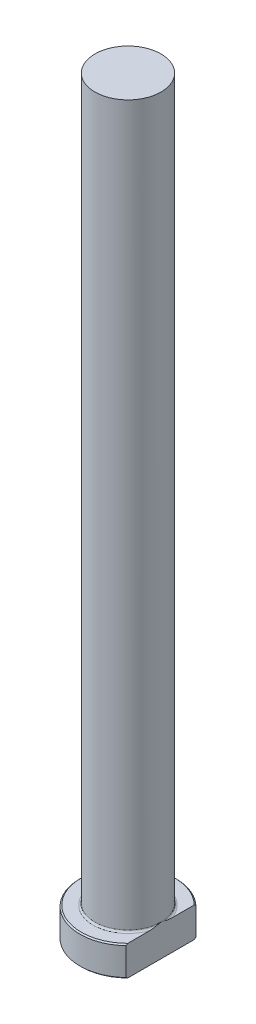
ISO-10303-21;
HEADER;
FILE_DESCRIPTION(('STEP AP214'),'2;1');
FILE_NAME('part.step','',(''),(''),'','','');
FILE_SCHEMA(('AUTOMOTIVE_DESIGN { 1 0 10303 214 1 1 1 1 }'));
ENDSEC;
DATA;
#1=APPLICATION_CONTEXT('core data for automotive mechanical design processes');
#2=APPLICATION_PROTOCOL_DEFINITION('international standard','automotive_design',2000,#1);
#3=PRODUCT_CONTEXT('',#1,'mechanical');
#4=PRODUCT('Part','Part','',(#3));
#5=PRODUCT_RELATED_PRODUCT_CATEGORY('part','',(#4));
#6=PRODUCT_DEFINITION_FORMATION('','',#4);
#7=PRODUCT_DEFINITION_CONTEXT('part definition',#1,'design');
#8=PRODUCT_DEFINITION('design','',#6,#7);
#9=PRODUCT_DEFINITION_SHAPE('','',#8);
#10=(LENGTH_UNIT() NAMED_UNIT(*) SI_UNIT(.MILLI.,.METRE.));
#11=(NAMED_UNIT(*) PLANE_ANGLE_UNIT() SI_UNIT($,.RADIAN.));
#12=(NAMED_UNIT(*) SI_UNIT($,.STERADIAN.) SOLID_ANGLE_UNIT());
#13=UNCERTAINTY_MEASURE_WITH_UNIT(LENGTH_MEASURE(1.E-05),#10,'distance_accuracy_value','');
#14=(GEOMETRIC_REPRESENTATION_CONTEXT(3) GLOBAL_UNCERTAINTY_ASSIGNED_CONTEXT((#13)) GLOBAL_UNIT_ASSIGNED_CONTEXT((#10,
#11,#12)) REPRESENTATION_CONTEXT('',''));
#15=CARTESIAN_POINT('',(0.,0.,0.));
#16=DIRECTION('',(0.,0.,1.));
#17=DIRECTION('',(1.,0.,0.));
#18=AXIS2_PLACEMENT_3D('',#15,#16,#17);
#19=CARTESIAN_POINT('',(0.,0.,0.));
#20=DIRECTION('',(0.,-1.,0.));
#21=DIRECTION('',(0.,0.,-1.));
#22=AXIS2_PLACEMENT_3D('',#19,#20,#21);
#23=PLANE('',#22);
#24=CARTESIAN_POINT('',(0.,0.,0.));
#25=DIRECTION('',(0.,-1.,0.));
#26=DIRECTION('',(0.,0.,-1.));
#27=AXIS2_PLACEMENT_3D('',#24,#25,#26);
#28=CIRCLE('',#27,7.80000000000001);
#29=CARTESIAN_POINT('',(5.49999999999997,0.,5.53082272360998));
#30=VERTEX_POINT('',#29);
#31=CARTESIAN_POINT('',(5.49999999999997,0.,-5.53082272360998));
#32=VERTEX_POINT('',#31);
#33=EDGE_CURVE('E98',#30,#32,#28,.T.);
#34=ORIENTED_EDGE('',*,*,#33,.T.);
#35=DIRECTION('',(0.,0.,1.));
#36=VECTOR('',#35,1.);
#37=CARTESIAN_POINT('',(5.49999999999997,0.,-5.80947501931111));
#38=LINE('',#37,#36);
#39=EDGE_CURVE('E83',#32,#30,#38,.T.);
#40=ORIENTED_EDGE('',*,*,#39,.T.);
#41=EDGE_LOOP('',(#34,#40));
#42=FACE_BOUND('',#41,.T.);
#43=ADVANCED_FACE('F32',(#42),#23,.T.);
#44=CARTESIAN_POINT('',(0.,259.958771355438,0.));
#45=DIRECTION('',(0.,1.,0.));
#46=DIRECTION('',(0.,0.,1.));
#47=AXIS2_PLACEMENT_3D('',#44,#45,#46);
#48=CYLINDRICAL_SURFACE('',#47,7.99999999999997);
#49=CARTESIAN_POINT('',(0.,4.79999999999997,0.));
#50=DIRECTION('',(0.,1.,0.));
#51=DIRECTION('',(0.,0.,1.));
#52=AXIS2_PLACEMENT_3D('',#49,#50,#51);
#53=CIRCLE('',#52,7.99999999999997);
#54=CARTESIAN_POINT('',(5.49999999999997,4.79999999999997,5.80947501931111));
#55=VERTEX_POINT('',#54);
#56=CARTESIAN_POINT('',(5.49999999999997,4.79999999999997,-5.80947501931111));
#57=VERTEX_POINT('',#56);
#58=EDGE_CURVE('E104',#55,#57,#53,.F.);
#59=ORIENTED_EDGE('',*,*,#58,.T.);
#60=DIRECTION('',(0.,-1.,0.));
#61=VECTOR('',#60,1.);
#62=CARTESIAN_POINT('',(5.49999999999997,125.,-5.80947501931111));
#63=LINE('',#62,#61);
#64=CARTESIAN_POINT('',(5.49999999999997,0.199999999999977,-5.80947501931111));
#65=VERTEX_POINT('',#64);
#66=EDGE_CURVE('E183',#57,#65,#63,.T.);
#67=ORIENTED_EDGE('',*,*,#66,.T.);
#68=CARTESIAN_POINT('',(0.,0.199999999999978,0.));
#69=DIRECTION('',(0.,-1.,0.));
#70=DIRECTION('',(0.,0.,-1.));
#71=AXIS2_PLACEMENT_3D('',#68,#69,#70);
#72=CIRCLE('',#71,7.99999999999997);
#73=CARTESIAN_POINT('',(5.49999999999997,0.199999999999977,5.80947501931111));
#74=VERTEX_POINT('',#73);
#75=EDGE_CURVE('E100',#65,#74,#72,.F.);
#76=ORIENTED_EDGE('',*,*,#75,.T.);
#77=DIRECTION('',(0.,-1.,0.));
#78=VECTOR('',#77,1.);
#79=CARTESIAN_POINT('',(5.49999999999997,125.,5.80947501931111));
#80=LINE('',#79,#78);
#81=EDGE_CURVE('E93',#55,#74,#80,.T.);
#82=ORIENTED_EDGE('',*,*,#81,.F.);
#83=EDGE_LOOP('',(#59,#67,#76,#82));
#84=FACE_BOUND('',#83,.T.);
#85=ADVANCED_FACE('F158',(#84),#48,.T.);
#86=CARTESIAN_POINT('',(-7.99999999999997,5.,0.));
#87=DIRECTION('',(0.,1.,0.));
#88=DIRECTION('',(0.,0.,1.));
#89=AXIS2_PLACEMENT_3D('',#86,#87,#88);
#90=PLANE('',#89);
#91=CARTESIAN_POINT('',(0.,5.,0.));
#92=DIRECTION('',(0.,1.,0.));
#93=DIRECTION('',(0.,0.,1.));
#94=AXIS2_PLACEMENT_3D('',#91,#92,#93);
#95=CIRCLE('',#94,7.79999999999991);
#96=CARTESIAN_POINT('',(5.49999999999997,5.,-5.53082272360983));
#97=VERTEX_POINT('',#96);
#98=CARTESIAN_POINT('',(5.49999999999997,5.,5.53082272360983));
#99=VERTEX_POINT('',#98);
#100=EDGE_CURVE('E178',#97,#99,#95,.T.);
#101=ORIENTED_EDGE('',*,*,#100,.T.);
#102=DIRECTION('',(0.,0.,-1.));
#103=VECTOR('',#102,1.);
#104=CARTESIAN_POINT('',(5.49999999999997,5.,0.));
#105=LINE('',#104,#103);
#106=CARTESIAN_POINT('',(5.49999999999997,4.99999999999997,1.84119526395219));
#107=VERTEX_POINT('',#106);
#108=EDGE_CURVE('E57',#99,#107,#105,.T.);
#109=ORIENTED_EDGE('',*,*,#108,.T.);
#110=CARTESIAN_POINT('',(0.,5.,0.));
#111=DIRECTION('',(0.,1.,0.));
#112=DIRECTION('',(0.,0.,1.));
#113=AXIS2_PLACEMENT_3D('',#110,#111,#112);
#114=CIRCLE('',#113,5.79999999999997);
#115=CARTESIAN_POINT('',(5.49999999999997,4.99999999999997,-1.84119526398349));
#116=VERTEX_POINT('',#115);
#117=EDGE_CURVE('E107',#107,#116,#114,.F.);
#118=ORIENTED_EDGE('',*,*,#117,.T.);
#119=EDGE_CURVE('E136',#116,#97,#105,.T.);
#120=ORIENTED_EDGE('',*,*,#119,.T.);
#121=EDGE_LOOP('',(#101,#109,#118,#120));
#122=FACE_BOUND('',#121,.T.);
#123=ADVANCED_FACE('F147',(#122),#90,.T.);
#124=CARTESIAN_POINT('',(0.,5.,0.));
#125=DIRECTION('',(0.,-1.,0.));
#126=DIRECTION('',(0.,0.,-1.));
#127=AXIS2_PLACEMENT_3D('',#124,#125,#126);
#128=CONICAL_SURFACE('',#127,7.7999999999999,0.785398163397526);
#129=ORIENTED_EDGE('',*,*,#58,.F.);
#130=CARTESIAN_POINT('',(5.49999999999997,-1.11515403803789,12.7820777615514));
#131=CARTESIAN_POINT('',(5.49999999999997,-0.941517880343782,12.5930460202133));
#132=CARTESIAN_POINT('',(5.49999999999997,-0.768204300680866,12.4037180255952));
#133=CARTESIAN_POINT('',(5.49999999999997,-0.422318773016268,12.0243831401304));
#134=CARTESIAN_POINT('',(5.49999999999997,-0.249746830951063,11.8343762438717));
#135=CARTESIAN_POINT('',(5.49999999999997,0.266785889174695,11.2631256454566));
#136=CARTESIAN_POINT('',(5.49999999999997,0.609484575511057,10.8807378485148));
#137=CARTESIAN_POINT('',(5.49999999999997,1.2925654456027,10.1095655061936));
#138=CARTESIAN_POINT('',(5.49999999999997,1.63291928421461,9.72075580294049));
#139=CARTESIAN_POINT('',(5.49999999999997,2.30738282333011,8.93782165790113));
#140=CARTESIAN_POINT('',(5.49999999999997,2.64149328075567,8.54369787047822));
#141=CARTESIAN_POINT('',(5.49999999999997,3.24251408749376,7.81851180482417));
#142=CARTESIAN_POINT('',(5.49999999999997,3.51085021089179,7.48863708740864));
#143=CARTESIAN_POINT('',(5.49999999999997,3.90712731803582,6.98880713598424));
#144=CARTESIAN_POINT('',(5.49999999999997,4.03820076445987,6.82133570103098));
#145=CARTESIAN_POINT('',(5.49999999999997,4.2978404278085,6.48446279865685));
#146=CARTESIAN_POINT('',(5.49999999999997,4.42640670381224,6.31506137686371));
#147=CARTESIAN_POINT('',(5.49999999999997,4.68038690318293,5.97419641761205));
#148=CARTESIAN_POINT('',(5.49999999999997,4.80580413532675,5.80273535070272));
#149=CARTESIAN_POINT('',(5.49999999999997,5.05297330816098,5.45719748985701));
#150=CARTESIAN_POINT('',(5.49999999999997,5.17472543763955,5.28312083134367));
#151=CARTESIAN_POINT('',(5.49999999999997,5.41367984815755,4.93196486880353));
#152=CARTESIAN_POINT('',(5.49999999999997,5.53088395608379,4.75488681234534));
#153=CARTESIAN_POINT('',(5.49999999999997,5.75968250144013,4.3971560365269));
#154=CARTESIAN_POINT('',(5.49999999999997,5.87127761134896,4.21650374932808));
#155=CARTESIAN_POINT('',(5.49999999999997,6.08629942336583,3.8529266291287));
#156=CARTESIAN_POINT('',(5.49999999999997,6.18979942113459,3.67004539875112));
#157=CARTESIAN_POINT('',(5.49999999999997,6.38808999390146,3.29955746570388));
#158=CARTESIAN_POINT('',(5.49999999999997,6.48287965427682,3.11195026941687));
#159=CARTESIAN_POINT('',(5.49999999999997,6.66127167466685,2.73169295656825));
#160=CARTESIAN_POINT('',(5.49999999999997,6.74488626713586,2.53904863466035));
#161=CARTESIAN_POINT('',(5.49999999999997,6.89808375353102,2.14822839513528));
#162=CARTESIAN_POINT('',(5.49999999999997,6.96767069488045,1.95005409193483));
#163=CARTESIAN_POINT('',(5.49999999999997,7.07670147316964,1.59030424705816));
#164=CARTESIAN_POINT('',(5.49999999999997,7.1194052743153,1.42972239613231));
#165=CARTESIAN_POINT('',(5.49999999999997,7.19217730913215,1.10570020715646));
#166=CARTESIAN_POINT('',(5.49999999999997,7.2222472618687,0.942260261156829));
#167=CARTESIAN_POINT('',(5.49999999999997,7.26823317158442,0.613832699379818));
#168=CARTESIAN_POINT('',(5.49999999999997,7.28418798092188,0.448850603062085));
#169=CARTESIAN_POINT('',(5.49999999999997,7.30121051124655,0.118111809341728));
#170=CARTESIAN_POINT('',(5.49999999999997,7.3022786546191,-0.0476448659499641));
#171=CARTESIAN_POINT('',(5.49999999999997,7.28946437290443,-0.37864328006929));
#172=CARTESIAN_POINT('',(5.49999999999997,7.27557532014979,-0.543884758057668));
#173=CARTESIAN_POINT('',(5.49999999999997,7.23360586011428,-0.872541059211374));
#174=CARTESIAN_POINT('',(5.49999999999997,7.20552424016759,-1.03595572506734));
#175=CARTESIAN_POINT('',(5.49999999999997,7.13645491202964,-1.36050703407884));
#176=CARTESIAN_POINT('',(5.49999999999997,7.09542895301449,-1.52163542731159));
#177=CARTESIAN_POINT('',(5.49999999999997,7.0022009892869,-1.8405836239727));
#178=CARTESIAN_POINT('',(5.49999999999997,6.94999898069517,-1.99840342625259));
#179=CARTESIAN_POINT('',(5.49999999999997,6.82412729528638,-2.34351289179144));
#180=CARTESIAN_POINT('',(5.49999999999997,6.74825204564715,-2.52999311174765));
#181=CARTESIAN_POINT('',(5.49999999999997,6.58537605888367,-2.89807095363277));
#182=CARTESIAN_POINT('',(5.49999999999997,6.49837001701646,-3.0796661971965));
#183=CARTESIAN_POINT('',(5.49999999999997,6.31536700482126,-3.43865575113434));
#184=CARTESIAN_POINT('',(5.49999999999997,6.21935375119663,-3.61604169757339));
#185=CARTESIAN_POINT('',(5.49999999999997,6.02029718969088,-3.96676299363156));
#186=CARTESIAN_POINT('',(5.49999999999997,5.91725492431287,-4.14009893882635));
#187=CARTESIAN_POINT('',(5.49999999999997,5.70428964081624,-4.48528329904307));
#188=CARTESIAN_POINT('',(5.49999999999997,5.59430018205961,-4.65709053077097));
#189=CARTESIAN_POINT('',(5.49999999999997,5.36966321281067,-4.99762683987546));
#190=CARTESIAN_POINT('',(5.49999999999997,5.25501557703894,-5.16635583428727));
#191=CARTESIAN_POINT('',(5.49999999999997,5.02205528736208,-5.50098485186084));
#192=CARTESIAN_POINT('',(5.49999999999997,4.90374674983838,-5.66688774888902));
#193=CARTESIAN_POINT('',(5.49999999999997,4.66400808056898,-5.99642589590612));
#194=CARTESIAN_POINT('',(5.49999999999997,4.54257783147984,-6.16006106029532));
#195=CARTESIAN_POINT('',(5.49999999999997,4.20154795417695,-6.6120771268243));
#196=CARTESIAN_POINT('',(5.49999999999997,3.97915323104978,-6.89834873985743));
#197=CARTESIAN_POINT('',(5.49999999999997,3.5283586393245,-7.4661257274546));
#198=CARTESIAN_POINT('',(5.49999999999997,3.29995838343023,-7.74763079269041));
#199=CARTESIAN_POINT('',(5.49999999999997,2.83846100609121,-8.30706072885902));
#200=CARTESIAN_POINT('',(5.49999999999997,2.60536095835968,-8.58498318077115));
#201=CARTESIAN_POINT('',(5.49999999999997,2.1356330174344,-9.13783071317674));
#202=CARTESIAN_POINT('',(5.49999999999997,1.89900507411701,-9.41275575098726));
#203=CARTESIAN_POINT('',(5.49999999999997,1.43345389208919,-9.94811769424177));
#204=CARTESIAN_POINT('',(5.49999999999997,1.20465068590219,-10.2086591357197));
#205=CARTESIAN_POINT('',(5.49999999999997,0.744976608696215,-10.7279148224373));
#206=CARTESIAN_POINT('',(5.49999999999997,0.514105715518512,-10.986629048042));
#207=CARTESIAN_POINT('',(5.49999999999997,0.0509694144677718,-11.5022006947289));
#208=CARTESIAN_POINT('',(5.49999999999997,-0.181293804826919,-11.7590600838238));
#209=CARTESIAN_POINT('',(5.49999999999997,-0.647231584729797,-12.2714820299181));
#210=CARTESIAN_POINT('',(5.49999999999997,-0.880906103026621,-12.5270446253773));
#211=CARTESIAN_POINT('',(5.49999999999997,-1.11515403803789,-12.7820777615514));
#212=B_SPLINE_CURVE_WITH_KNOTS('',3,(#130,#131,#132,#133,#134,#135,#136,#137,#138,#139,#140,
#141,#142,#143,#144,#145,#146,#147,#148,#149,#150,#151,#152,#153,#154,#155,#156,#157,#158,#159,
#160,#161,#162,#163,#164,#165,#166,#167,#168,#169,#170,#171,#172,#173,#174,#175,#176,#177,#178,
#179,#180,#181,#182,#183,#184,#185,#186,#187,#188,#189,#190,#191,#192,#193,#194,#195,#196,#197,
#198,#199,#200,#201,#202,#203,#204,#205,#206,#207,#208,#209,#210,#211),.UNSPECIFIED.,.F.,.F.,(4,
2,2,2,2,2,2,2,2,2,2,2,2,2,2,2,2,2,2,2,2,2,2,2,2,2,2,2,2,2,2,2,2,2,2,2,2,2,2,2,4),(0.,
0.770026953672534,1.54006005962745,3.08047615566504,4.63063153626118,6.18059774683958,
7.45618053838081,8.09416066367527,8.73212573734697,9.36938977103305,10.0066209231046,
10.6435933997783,11.2804893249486,11.910716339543,12.5410094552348,13.1706068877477,
13.8000224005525,14.2980757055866,14.7960612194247,15.2926717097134,15.789268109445,
16.2860846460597,16.7829436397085,17.281284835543,17.7796262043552,18.3831348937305,
18.9869322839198,19.5918430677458,20.1966643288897,20.8085675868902,21.4204873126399,
22.0317423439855,22.6430203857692,23.7304168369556,24.8178835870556,25.9060497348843,
26.9942313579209,28.0344561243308,29.0746920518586,30.1135832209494,31.1524433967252),.UNSPECIFIED.);
#213=EDGE_CURVE('E135',#55,#99,#212,.T.);
#214=ORIENTED_EDGE('',*,*,#213,.T.);
#215=ORIENTED_EDGE('',*,*,#100,.F.);
#216=EDGE_CURVE('E127',#97,#57,#212,.T.);
#217=ORIENTED_EDGE('',*,*,#216,.T.);
#218=EDGE_LOOP('',(#129,#214,#215,#217));
#219=FACE_BOUND('',#218,.T.);
#220=ADVANCED_FACE('F143',(#219),#128,.T.);
#221=CARTESIAN_POINT('',(0.,0.199999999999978,0.));
#222=DIRECTION('',(0.,1.,0.));
#223=DIRECTION('',(0.,0.,1.));
#224=AXIS2_PLACEMENT_3D('',#221,#222,#223);
#225=CONICAL_SURFACE('',#224,7.99999999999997,0.785398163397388);
#226=ORIENTED_EDGE('',*,*,#75,.F.);
#227=CARTESIAN_POINT('',(5.49999999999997,6.11515403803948,-12.7820777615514));
#228=CARTESIAN_POINT('',(5.49999999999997,5.94151788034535,-12.5930460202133));
#229=CARTESIAN_POINT('',(5.49999999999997,5.76820430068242,-12.4037180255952));
#230=CARTESIAN_POINT('',(5.49999999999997,5.42231877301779,-12.0243831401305));
#231=CARTESIAN_POINT('',(5.49999999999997,5.24974683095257,-11.8343762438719));
#232=CARTESIAN_POINT('',(5.49999999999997,4.73321411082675,-11.2631256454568));
#233=CARTESIAN_POINT('',(5.49999999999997,4.39051542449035,-10.8807378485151));
#234=CARTESIAN_POINT('',(5.49999999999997,3.70743455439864,-10.1095655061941));
#235=CARTESIAN_POINT('',(5.49999999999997,3.3670807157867,-9.72075580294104));
#236=CARTESIAN_POINT('',(5.49999999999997,2.69261717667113,-8.93782165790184));
#237=CARTESIAN_POINT('',(5.49999999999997,2.35850671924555,-8.543697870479));
#238=CARTESIAN_POINT('',(5.49999999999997,1.75748591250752,-7.81851180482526));
#239=CARTESIAN_POINT('',(5.49999999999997,1.48914978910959,-7.48863708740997));
#240=CARTESIAN_POINT('',(5.49999999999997,1.0928726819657,-6.98880713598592));
#241=CARTESIAN_POINT('',(5.49999999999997,0.961799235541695,-6.82133570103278));
#242=CARTESIAN_POINT('',(5.49999999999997,0.702159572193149,-6.48446279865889));
#243=CARTESIAN_POINT('',(5.49999999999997,0.573593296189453,-6.31506137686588));
#244=CARTESIAN_POINT('',(5.49999999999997,0.319613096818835,-5.97419641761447));
#245=CARTESIAN_POINT('',(5.49999999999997,0.194195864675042,-5.80273535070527));
#246=CARTESIAN_POINT('',(5.49999999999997,-0.0529733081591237,-5.45719748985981));
#247=CARTESIAN_POINT('',(5.49999999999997,-0.17472543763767,-5.2831208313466));
#248=CARTESIAN_POINT('',(5.49999999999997,-0.413679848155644,-4.93196486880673));
#249=CARTESIAN_POINT('',(5.49999999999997,-0.530883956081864,-4.75488681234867));
#250=CARTESIAN_POINT('',(5.49999999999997,-0.759682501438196,-4.39715603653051));
#251=CARTESIAN_POINT('',(5.49999999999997,-0.871277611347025,-4.21650374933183));
#252=CARTESIAN_POINT('',(5.49999999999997,-1.08629942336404,-3.85292662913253));
#253=CARTESIAN_POINT('',(5.49999999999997,-1.18979942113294,-3.67004539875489));
#254=CARTESIAN_POINT('',(5.49999999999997,-1.38808999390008,-3.29955746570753));
#255=CARTESIAN_POINT('',(5.49999999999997,-1.48287965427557,-3.11195026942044));
#256=CARTESIAN_POINT('',(5.49999999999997,-1.66127167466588,-2.73169295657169));
#257=CARTESIAN_POINT('',(5.49999999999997,-1.74488626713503,-2.53904863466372));
#258=CARTESIAN_POINT('',(5.49999999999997,-1.89808375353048,-2.14822839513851));
#259=CARTESIAN_POINT('',(5.49999999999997,-1.96767069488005,-1.95005409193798));
#260=CARTESIAN_POINT('',(5.49999999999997,-2.07670147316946,-1.59030424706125));
#261=CARTESIAN_POINT('',(5.49999999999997,-2.11940527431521,-1.42972239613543));
#262=CARTESIAN_POINT('',(5.49999999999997,-2.19217730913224,-1.10570020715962));
#263=CARTESIAN_POINT('',(5.49999999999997,-2.22224726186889,-0.942260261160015));
#264=CARTESIAN_POINT('',(5.49999999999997,-2.2682331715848,-0.613832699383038));
#265=CARTESIAN_POINT('',(5.49999999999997,-2.28418798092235,-0.448850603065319));
#266=CARTESIAN_POINT('',(5.49999999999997,-2.30121051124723,-0.118111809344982));
#267=CARTESIAN_POINT('',(5.49999999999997,-2.30227865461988,0.0476448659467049));
#268=CARTESIAN_POINT('',(5.49999999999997,-2.2894643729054,0.378643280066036));
#269=CARTESIAN_POINT('',(5.49999999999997,-2.27557532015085,0.543884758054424));
#270=CARTESIAN_POINT('',(5.49999999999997,-2.23360586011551,0.872541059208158));
#271=CARTESIAN_POINT('',(5.49999999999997,-2.2055242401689,1.03595572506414));
#272=CARTESIAN_POINT('',(5.49999999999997,-2.1364549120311,1.36050703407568));
#273=CARTESIAN_POINT('',(5.49999999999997,-2.09542895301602,1.52163542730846));
#274=CARTESIAN_POINT('',(5.49999999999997,-2.00220098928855,1.8405836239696));
#275=CARTESIAN_POINT('',(5.49999999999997,-1.94999898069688,1.99840342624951));
#276=CARTESIAN_POINT('',(5.49999999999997,-1.82412729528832,2.34351289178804));
#277=CARTESIAN_POINT('',(5.49999999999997,-1.7482520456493,2.52999311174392));
#278=CARTESIAN_POINT('',(5.49999999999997,-1.58537605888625,2.8980709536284));
#279=CARTESIAN_POINT('',(5.49999999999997,-1.49837001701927,3.07966619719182));
#280=CARTESIAN_POINT('',(5.49999999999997,-1.31536700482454,3.43865575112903));
#281=CARTESIAN_POINT('',(5.49999999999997,-1.21935375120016,3.61604169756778));
#282=CARTESIAN_POINT('',(5.49999999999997,-1.02029718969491,3.96676299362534));
#283=CARTESIAN_POINT('',(5.49999999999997,-0.917254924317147,4.14009893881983));
#284=CARTESIAN_POINT('',(5.49999999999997,-0.704289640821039,4.48528329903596));
#285=CARTESIAN_POINT('',(5.49999999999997,-0.594300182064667,4.65709053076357));
#286=CARTESIAN_POINT('',(5.49999999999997,-0.369663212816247,4.99762683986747));
#287=CARTESIAN_POINT('',(5.49999999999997,-0.255015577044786,5.16635583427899));
#288=CARTESIAN_POINT('',(5.49999999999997,-0.0220552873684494,5.50098485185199));
#289=CARTESIAN_POINT('',(5.49999999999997,0.096253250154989,5.66688774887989));
#290=CARTESIAN_POINT('',(5.49999999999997,0.335991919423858,5.99642589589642));
#291=CARTESIAN_POINT('',(5.49999999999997,0.457422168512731,6.16006106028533));
#292=CARTESIAN_POINT('',(5.49999999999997,0.798452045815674,6.61207712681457));
#293=CARTESIAN_POINT('',(5.49999999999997,1.02084676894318,6.89834873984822));
#294=CARTESIAN_POINT('',(5.49999999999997,1.47164136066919,7.46612572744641));
#295=CARTESIAN_POINT('',(5.49999999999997,1.70004161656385,7.74763079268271));
#296=CARTESIAN_POINT('',(5.49999999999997,2.16153899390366,8.30706072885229));
#297=CARTESIAN_POINT('',(5.49999999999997,2.3946390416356,8.58498318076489));
#298=CARTESIAN_POINT('',(5.49999999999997,2.86436698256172,9.13783071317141));
#299=CARTESIAN_POINT('',(5.49999999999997,3.10099492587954,9.41275575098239));
#300=CARTESIAN_POINT('',(5.49999999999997,3.56654610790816,9.94811769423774));
#301=CARTESIAN_POINT('',(5.49999999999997,3.79534931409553,10.2086591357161));
#302=CARTESIAN_POINT('',(5.49999999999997,4.25502339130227,10.7279148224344));
#303=CARTESIAN_POINT('',(5.49999999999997,4.48589428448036,10.9866290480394));
#304=CARTESIAN_POINT('',(5.49999999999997,4.94903058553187,11.5022006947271));
#305=CARTESIAN_POINT('',(5.49999999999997,5.18129380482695,11.7590600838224));
#306=CARTESIAN_POINT('',(5.49999999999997,5.6472315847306,12.2714820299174));
#307=CARTESIAN_POINT('',(5.49999999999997,5.88090610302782,12.5270446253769));
#308=CARTESIAN_POINT('',(5.49999999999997,6.11515403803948,12.7820777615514));
#309=B_SPLINE_CURVE_WITH_KNOTS('',3,(#227,#228,#229,#230,#231,#232,#233,#234,#235,#236,#237,
#238,#239,#240,#241,#242,#243,#244,#245,#246,#247,#248,#249,#250,#251,#252,#253,#254,#255,#256,
#257,#258,#259,#260,#261,#262,#263,#264,#265,#266,#267,#268,#269,#270,#271,#272,#273,#274,#275,
#276,#277,#278,#279,#280,#281,#282,#283,#284,#285,#286,#287,#288,#289,#290,#291,#292,#293,#294,
#295,#296,#297,#298,#299,#300,#301,#302,#303,#304,#305,#306,#307,#308),.UNSPECIFIED.,.F.,.F.,(4,
2,2,2,2,2,2,2,2,2,2,2,2,2,2,2,2,2,2,2,2,2,2,2,2,2,2,2,2,2,2,2,2,2,2,2,2,2,2,2,4),(0.,
0.770026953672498,1.54006005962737,3.08047615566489,4.63063153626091,6.1805977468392,
7.4561805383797,8.0941606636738,8.73212573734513,9.36938977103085,10.006620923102,
10.6435933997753,11.2804893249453,11.9107163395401,12.5410094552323,13.1706068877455,
13.8000224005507,14.2980757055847,14.7960612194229,15.2926717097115,15.7892681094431,
16.2860846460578,16.7829436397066,17.2812848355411,17.7796262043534,18.3831348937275,
18.9869322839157,19.5918430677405,20.1966643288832,20.8085675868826,21.4204873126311,
22.0317423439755,22.643020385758,23.7304168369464,24.8178835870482,25.9060497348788,
26.9942313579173,28.0344561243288,29.0746920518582,30.1135832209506,31.1524433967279),.UNSPECIFIED.);
#310=EDGE_CURVE('E86',#65,#32,#309,.T.);
#311=ORIENTED_EDGE('',*,*,#310,.T.);
#312=ORIENTED_EDGE('',*,*,#33,.F.);
#313=EDGE_CURVE('E89',#30,#74,#309,.T.);
#314=ORIENTED_EDGE('',*,*,#313,.T.);
#315=EDGE_LOOP('',(#226,#311,#312,#314));
#316=FACE_BOUND('',#315,.T.);
#317=ADVANCED_FACE('F97',(#316),#225,.T.);
#318=CARTESIAN_POINT('',(0.,5.29999999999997,0.));
#319=DIRECTION('',(0.,1.,0.));
#320=DIRECTION('',(0.,0.,1.));
#321=AXIS2_PLACEMENT_3D('',#318,#319,#320);
#322=TOROIDAL_SURFACE('',#321,5.79999999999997,0.3);
#323=CARTESIAN_POINT('',(5.49999999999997,5.29999999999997,0.));
#324=CARTESIAN_POINT('',(5.49999999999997,5.30000062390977,1.37321730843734E-10));
#325=CARTESIAN_POINT('',(5.49999999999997,5.30000124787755,-2.69376376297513E-07));
#326=CARTESIAN_POINT('',(5.49999999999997,5.30000240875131,-9.99151691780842E-07));
#327=CARTESIAN_POINT('',(5.49999999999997,5.30000292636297,-1.47834826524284E-06));
#328=CARTESIAN_POINT('',(5.49999999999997,5.30000401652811,-2.63038637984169E-06));
#329=CARTESIAN_POINT('',(5.49999999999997,5.3000045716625,-3.32194614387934E-06));
#330=CARTESIAN_POINT('',(5.49999999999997,5.30000555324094,-4.74435536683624E-06));
#331=CARTESIAN_POINT('',(5.49999999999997,5.30000598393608,-5.47253605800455E-06));
#332=CARTESIAN_POINT('',(5.49999999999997,5.30000761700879,-8.33560288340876E-06));
#333=CARTESIAN_POINT('',(5.49999999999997,5.30000873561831,-1.05221151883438E-05));
#334=CARTESIAN_POINT('',(5.49999999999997,5.30001054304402,-1.48184286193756E-05));
#335=CARTESIAN_POINT('',(5.49999999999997,5.30001126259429,-1.69157853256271E-05));
#336=CARTESIAN_POINT('',(5.49999999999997,5.30001433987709,-2.59119235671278E-05));
#337=CARTESIAN_POINT('',(5.49999999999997,5.30001667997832,-3.28197570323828E-05));
#338=CARTESIAN_POINT('',(5.49999999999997,5.30002006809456,-4.57841698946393E-05));
#339=CARTESIAN_POINT('',(5.49999999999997,5.30002126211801,-5.18021293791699E-05));
#340=CARTESIAN_POINT('',(5.49999999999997,5.30003004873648,-9.68722229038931E-05));
#341=CARTESIAN_POINT('',(5.49999999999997,5.30003680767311,-0.000136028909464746));
#342=CARTESIAN_POINT('',(5.49999999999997,5.30006639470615,-0.000291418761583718));
#343=CARTESIAN_POINT('',(5.49999999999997,5.30009452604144,-0.000406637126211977));
#344=CARTESIAN_POINT('',(5.49999999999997,5.30020462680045,-0.000864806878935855));
#345=CARTESIAN_POINT('',(5.49999999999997,5.30028324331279,-0.00120829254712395));
#346=CARTESIAN_POINT('',(5.49999999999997,5.3005992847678,-0.00257937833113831));
#347=CARTESIAN_POINT('',(5.49999999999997,5.300840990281,-0.00360627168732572));
#348=CARTESIAN_POINT('',(5.49999999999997,5.30184970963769,-0.00790277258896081));
#349=CARTESIAN_POINT('',(5.49999999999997,5.30261131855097,-0.0111732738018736));
#350=CARTESIAN_POINT('',(5.49999999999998,5.30969442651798,-0.0415753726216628));
#351=CARTESIAN_POINT('',(5.49999999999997,5.31603915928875,-0.0687032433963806));
#352=CARTESIAN_POINT('',(5.49999999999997,5.32843561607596,-0.121865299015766));
#353=CARTESIAN_POINT('',(5.49999999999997,5.33448878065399,-0.147899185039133));
#354=CARTESIAN_POINT('',(5.49999999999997,5.34733836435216,-0.203330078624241));
#355=CARTESIAN_POINT('',(5.49999999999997,5.35413005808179,-0.232728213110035));
#356=CARTESIAN_POINT('',(5.49999999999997,5.36771480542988,-0.29186839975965));
#357=CARTESIAN_POINT('',(5.49999999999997,5.37450703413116,-0.321610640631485));
#358=CARTESIAN_POINT('',(5.49999999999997,5.3907398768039,-0.393246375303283));
#359=CARTESIAN_POINT('',(5.49999999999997,5.40013144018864,-0.435151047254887));
#360=CARTESIAN_POINT('',(5.49999999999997,5.41839331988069,-0.517899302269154));
#361=CARTESIAN_POINT('',(5.49999999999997,5.42727085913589,-0.558741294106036));
#362=CARTESIAN_POINT('',(5.49999999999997,5.45304047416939,-0.679649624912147));
#363=CARTESIAN_POINT('',(5.49999999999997,5.46946475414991,-0.759817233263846));
#364=CARTESIAN_POINT('',(5.49999999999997,5.50059525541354,-0.921248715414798));
#365=CARTESIAN_POINT('',(5.49999999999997,5.5152844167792,-1.00251591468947));
#366=CARTESIAN_POINT('',(5.49999999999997,5.54326935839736,-1.17291320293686));
#367=CARTESIAN_POINT('',(5.49999999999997,5.55631639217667,-1.2620853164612));
#368=CARTESIAN_POINT('',(5.49999999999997,5.57807460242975,-1.4407267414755));
#369=CARTESIAN_POINT('',(5.49999999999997,5.5867974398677,-1.53019459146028));
#370=CARTESIAN_POINT('',(5.49999999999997,5.59813646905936,-1.70678130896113));
#371=CARTESIAN_POINT('',(5.49999999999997,5.60093453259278,-1.79388646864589));
#372=CARTESIAN_POINT('',(5.49999999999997,5.59913730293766,-1.92371114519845));
#373=CARTESIAN_POINT('',(5.49999999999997,5.59757869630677,-1.96647130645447));
#374=CARTESIAN_POINT('',(5.49999999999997,5.59207086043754,-2.0518267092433));
#375=CARTESIAN_POINT('',(5.49999999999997,5.58812304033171,-2.09442203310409));
#376=CARTESIAN_POINT('',(5.49999999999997,5.57845042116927,-2.16952357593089));
#377=CARTESIAN_POINT('',(5.49999999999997,5.57333912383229,-2.20210765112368));
#378=CARTESIAN_POINT('',(5.49999999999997,5.56085936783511,-2.26696451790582));
#379=CARTESIAN_POINT('',(5.49999999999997,5.55348387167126,-2.29923601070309));
#380=CARTESIAN_POINT('',(5.49999999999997,5.53578949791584,-2.36314331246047));
#381=CARTESIAN_POINT('',(5.49999999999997,5.52545654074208,-2.39477528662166));
#382=CARTESIAN_POINT('',(5.49999999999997,5.50076223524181,-2.45658585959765));
#383=CARTESIAN_POINT('',(5.49999999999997,5.48639841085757,-2.48676355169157));
#384=CARTESIAN_POINT('',(5.49999999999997,5.45845930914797,-2.53258359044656));
#385=CARTESIAN_POINT('',(5.49999999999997,5.4467285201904,-2.54933279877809));
#386=CARTESIAN_POINT('',(5.49999999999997,5.42036237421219,-2.58032609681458));
#387=CARTESIAN_POINT('',(5.49999999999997,5.40575448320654,-2.59459164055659));
#388=CARTESIAN_POINT('',(5.49999999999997,5.38269146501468,-2.61139952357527));
#389=CARTESIAN_POINT('',(5.49999999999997,5.37567288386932,-2.6159011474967));
#390=CARTESIAN_POINT('',(5.49999999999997,5.36105421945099,-2.62385691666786));
#391=CARTESIAN_POINT('',(5.49999999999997,5.35345422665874,-2.62731122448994));
#392=CARTESIAN_POINT('',(5.49999999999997,5.33769516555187,-2.63292915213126));
#393=CARTESIAN_POINT('',(5.49999999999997,5.32953131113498,-2.63507966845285));
#394=CARTESIAN_POINT('',(5.49999999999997,5.31294528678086,-2.63780090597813));
#395=CARTESIAN_POINT('',(5.49999999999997,5.3045234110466,-2.63837336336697));
#396=CARTESIAN_POINT('',(5.49999999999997,5.28851094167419,-2.63789663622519));
#397=CARTESIAN_POINT('',(5.49999999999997,5.2809155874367,-2.63699270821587));
#398=CARTESIAN_POINT('',(5.49999999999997,5.26598512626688,-2.63392394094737));
#399=CARTESIAN_POINT('',(5.49999999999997,5.25865020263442,-2.6317582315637));
#400=CARTESIAN_POINT('',(5.49999999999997,5.24234078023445,-2.62556604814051));
#401=CARTESIAN_POINT('',(5.49999999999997,5.23350275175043,-2.62118324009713));
#402=CARTESIAN_POINT('',(5.49999999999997,5.21664244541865,-2.61106244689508));
#403=CARTESIAN_POINT('',(5.49999999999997,5.20862200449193,-2.60532150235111));
#404=CARTESIAN_POINT('',(5.49999999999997,5.18881724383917,-2.58912168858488));
#405=CARTESIAN_POINT('',(5.49999999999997,5.17766341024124,-2.57789934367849));
#406=CARTESIAN_POINT('',(5.49999999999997,5.15712865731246,-2.55396421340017));
#407=CARTESIAN_POINT('',(5.49999999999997,5.14775124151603,-2.54124856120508));
#408=CARTESIAN_POINT('',(5.49999999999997,5.1219531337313,-2.50201772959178));
#409=CARTESIAN_POINT('',(5.49999999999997,5.10760202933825,-2.47415772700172));
#410=CARTESIAN_POINT('',(5.49999999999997,5.08264412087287,-2.4167036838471));
#411=CARTESIAN_POINT('',(5.49999999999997,5.07206513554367,-2.38709856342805));
#412=CARTESIAN_POINT('',(5.49999999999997,5.04919805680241,-2.31224104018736));
#413=CARTESIAN_POINT('',(5.49999999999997,5.0386368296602,-2.26646729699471));
#414=CARTESIAN_POINT('',(5.49999999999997,5.02182095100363,-2.17406875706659));
#415=CARTESIAN_POINT('',(5.49999999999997,5.01557941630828,-2.12744180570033));
#416=CARTESIAN_POINT('',(5.49999999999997,5.00649716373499,-2.0351579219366));
#417=CARTESIAN_POINT('',(5.49999999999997,5.00356804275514,-1.98950936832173));
#418=CARTESIAN_POINT('',(5.49999999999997,5.00016782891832,-1.8983460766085));
#419=CARTESIAN_POINT('',(5.49999999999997,4.99968533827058,-1.85283170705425));
#420=CARTESIAN_POINT('',(5.49999999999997,5.00090888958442,-1.74240379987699));
#421=CARTESIAN_POINT('',(5.49999999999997,5.00363706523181,-1.67750284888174));
#422=CARTESIAN_POINT('',(5.49999999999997,5.01218141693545,-1.54793822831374));
#423=CARTESIAN_POINT('',(5.49999999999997,5.01799679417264,-1.48327450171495));
#424=CARTESIAN_POINT('',(5.49999999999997,5.03222723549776,-1.35268561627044));
#425=CARTESIAN_POINT('',(5.49999999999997,5.0407007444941,-1.28676695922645));
#426=CARTESIAN_POINT('',(5.49999999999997,5.05968062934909,-1.1550540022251));
#427=CARTESIAN_POINT('',(5.49999999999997,5.07019222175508,-1.08926046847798));
#428=CARTESIAN_POINT('',(5.49999999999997,5.09695256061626,-0.933785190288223));
#429=CARTESIAN_POINT('',(5.49999999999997,5.11388903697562,-0.844222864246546));
#430=CARTESIAN_POINT('',(5.49999999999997,5.14958548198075,-0.666532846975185));
#431=CARTESIAN_POINT('',(5.49999999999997,5.1683224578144,-0.578400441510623));
#432=CARTESIAN_POINT('',(5.49999999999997,5.20478806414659,-0.412629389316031));
#433=CARTESIAN_POINT('',(5.49999999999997,5.22238111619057,-0.334960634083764));
#434=CARTESIAN_POINT('',(5.49999999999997,5.24959866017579,-0.216510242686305));
#435=CARTESIAN_POINT('',(5.49999999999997,5.25904905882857,-0.175687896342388));
#436=CARTESIAN_POINT('',(5.49999999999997,5.27788780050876,-0.0947269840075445));
#437=CARTESIAN_POINT('',(5.49999999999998,5.28727465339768,-0.0545880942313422));
#438=CARTESIAN_POINT('',(5.49999999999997,5.29739035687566,-0.0111657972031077));
#439=CARTESIAN_POINT('',(5.49999999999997,5.29815375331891,-0.00788783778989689));
#440=CARTESIAN_POINT('',(5.49999999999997,5.29916288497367,-0.00358966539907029));
#441=CARTESIAN_POINT('',(5.49999999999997,5.29940322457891,-0.00256856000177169));
#442=CARTESIAN_POINT('',(5.49999999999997,5.2997176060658,-0.00120467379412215));
#443=CARTESIAN_POINT('',(5.49999999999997,5.29979589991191,-0.000862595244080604));
#444=CARTESIAN_POINT('',(5.49999999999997,5.29990561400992,-0.000406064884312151));
#445=CARTESIAN_POINT('',(5.49999999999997,5.2999336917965,-0.000291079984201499));
#446=CARTESIAN_POINT('',(5.49999999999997,5.29996322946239,-0.000135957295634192));
#447=CARTESIAN_POINT('',(5.49999999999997,5.29996998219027,-9.68324215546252E-05));
#448=CARTESIAN_POINT('',(5.49999999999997,5.29997875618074,-5.17949381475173E-05));
#449=CARTESIAN_POINT('',(5.49999999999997,5.29997994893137,-4.57786558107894E-05));
#450=CARTESIAN_POINT('',(5.49999999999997,5.29998333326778,-3.28177654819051E-05));
#451=CARTESIAN_POINT('',(5.49999999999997,5.2999856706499,-2.59116891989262E-05));
#452=CARTESIAN_POINT('',(5.49999999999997,5.29998874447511,-1.69173980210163E-05));
#453=CARTESIAN_POINT('',(5.49999999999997,5.29998946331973,-1.4820166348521E-05));
#454=CARTESIAN_POINT('',(5.49999999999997,5.29999126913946,-1.05239951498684E-05));
#455=CARTESIAN_POINT('',(5.49999999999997,5.29999238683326,-8.33748307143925E-06));
#456=CARTESIAN_POINT('',(5.49999999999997,5.29999401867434,-5.47429219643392E-06));
#457=CARTESIAN_POINT('',(5.49999999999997,5.29999444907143,-4.74604003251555E-06));
#458=CARTESIAN_POINT('',(5.49999999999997,5.29999543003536,-3.32343406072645E-06));
#459=CARTESIAN_POINT('',(5.49999999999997,5.29999598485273,-2.63174656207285E-06));
#460=CARTESIAN_POINT('',(5.49999999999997,5.29999707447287,-1.47941235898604E-06));
#461=CARTESIAN_POINT('',(5.49999999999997,5.29999759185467,-1.00005962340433E-06));
#462=CARTESIAN_POINT('',(5.49999999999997,5.29999875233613,-2.69883386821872E-07));
#463=CARTESIAN_POINT('',(5.49999999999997,5.29999937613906,-1.37310971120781E-10));
#464=CARTESIAN_POINT('',(5.49999999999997,5.29999999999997,0.));
#465=B_SPLINE_CURVE_WITH_KNOTS('',3,(#323,#324,#325,#326,#327,#328,#329,#330,#331,#332,#333,
#334,#335,#336,#337,#338,#339,#340,#341,#342,#343,#344,#345,#346,#347,#348,#349,#350,#351,#352,
#353,#354,#355,#356,#357,#358,#359,#360,#361,#362,#363,#364,#365,#366,#367,#368,#369,#370,#371,
#372,#373,#374,#375,#376,#377,#378,#379,#380,#381,#382,#383,#384,#385,#386,#387,#388,#389,#390,
#391,#392,#393,#394,#395,#396,#397,#398,#399,#400,#401,#402,#403,#404,#405,#406,#407,#408,#409,
#410,#411,#412,#413,#414,#415,#416,#417,#418,#419,#420,#421,#422,#423,#424,#425,#426,#427,#428,
#429,#430,#431,#432,#433,#434,#435,#436,#437,#438,#439,#440,#441,#442,#443,#444,#445,#446,#447,
#448,#449,#450,#451,#452,#453,#454,#455,#456,#457,#458,#459,#460,#461,#462,#463,#464),
.UNSPECIFIED.,.T.,.F.,(4,2,2,2,2,2,2,2,2,2,2,2,2,2,2,2,2,2,2,2,2,2,2,2,2,2,2,2,2,2,2,2,2,2,2,2,
2,2,2,2,2,2,2,2,2,2,2,2,2,2,2,2,2,2,2,2,2,2,2,2,2,2,2,2,2,2,2,2,2,2,4),(0.,1.89759089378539E-06,
4.0217832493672E-06,6.66436842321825E-06,9.20151056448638E-06,1.65449719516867E-05,
2.31908325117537E-05,4.50383514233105E-05,6.34229836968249E-05,0.000182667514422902,
0.000538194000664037,0.00159559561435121,0.00476009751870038,0.0148345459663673,
0.0984122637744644,0.178597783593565,0.269114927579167,0.360638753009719,0.489470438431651,
0.61485697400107,0.860339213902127,1.10806331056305,1.37834904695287,1.64790189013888,
1.90905265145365,2.03736998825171,2.16561171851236,2.26450233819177,2.36370349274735,
2.46338500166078,2.56312787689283,2.62428570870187,2.68488576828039,2.7098322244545,
2.73477480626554,2.75996408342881,2.78512563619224,2.80795720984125,2.8308045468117,
2.86023439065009,2.88972896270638,2.93692759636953,2.98421836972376,3.07771161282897,
3.17188074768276,3.31245630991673,3.45345688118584,3.59059834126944,3.7271003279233,
3.92187072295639,4.11659074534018,4.31593390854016,4.51579419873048,4.78920516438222,
5.05949875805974,5.29840417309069,5.42411083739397,5.54777320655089,5.55787065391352,
5.56101731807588,5.56207038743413,5.56242519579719,5.56254434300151,5.56256272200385,
5.56258456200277,5.56259120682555,5.56259854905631,5.56260108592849,5.56260372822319,
5.56260585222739,5.5626077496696),.UNSPECIFIED.);
#466=CARTESIAN_POINT('',(5.49999999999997,5.29999999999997,0.));
#467=VERTEX_POINT('',#466);
#468=EDGE_CURVE('E11',#116,#467,#465,.T.);
#469=ORIENTED_EDGE('',*,*,#468,.F.);
#470=ORIENTED_EDGE('',*,*,#117,.F.);
#471=CARTESIAN_POINT('',(5.49999999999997,5.29999999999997,0.));
#472=CARTESIAN_POINT('',(5.49999999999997,5.29999937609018,-1.37321567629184E-10));
#473=CARTESIAN_POINT('',(5.49999999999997,5.29999875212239,2.69376376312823E-07));
#474=CARTESIAN_POINT('',(5.49999999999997,5.29999759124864,9.9915169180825E-07));
#475=CARTESIAN_POINT('',(5.49999999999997,5.29999707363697,1.47834826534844E-06));
#476=CARTESIAN_POINT('',(5.49999999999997,5.29999598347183,2.6303863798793E-06));
#477=CARTESIAN_POINT('',(5.49999999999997,5.29999542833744,3.32194614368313E-06));
#478=CARTESIAN_POINT('',(5.49999999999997,5.299994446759,4.74435536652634E-06));
#479=CARTESIAN_POINT('',(5.49999999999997,5.29999401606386,5.47253605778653E-06));
#480=CARTESIAN_POINT('',(5.49999999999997,5.29999238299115,8.33560288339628E-06));
#481=CARTESIAN_POINT('',(5.49999999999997,5.29999126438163,1.05221151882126E-05));
#482=CARTESIAN_POINT('',(5.49999999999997,5.29998945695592,1.48184286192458E-05));
#483=CARTESIAN_POINT('',(5.49999999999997,5.29998873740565,1.69157853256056E-05));
#484=CARTESIAN_POINT('',(5.49999999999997,5.29998566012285,2.59119235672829E-05));
#485=CARTESIAN_POINT('',(5.49999999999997,5.29998332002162,3.28197570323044E-05));
#486=CARTESIAN_POINT('',(5.49999999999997,5.29997993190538,4.57841698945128E-05));
#487=CARTESIAN_POINT('',(5.49999999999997,5.29997873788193,5.18021293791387E-05));
#488=CARTESIAN_POINT('',(5.49999999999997,5.29996995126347,9.68722229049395E-05));
#489=CARTESIAN_POINT('',(5.49999999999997,5.29996319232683,0.000136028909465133));
#490=CARTESIAN_POINT('',(5.49999999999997,5.29993360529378,0.000291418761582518));
#491=CARTESIAN_POINT('',(5.49999999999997,5.2999054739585,0.000406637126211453));
#492=CARTESIAN_POINT('',(5.49999999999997,5.2997953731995,0.000864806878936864));
#493=CARTESIAN_POINT('',(5.49999999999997,5.29971675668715,0.00120829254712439));
#494=CARTESIAN_POINT('',(5.49999999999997,5.29940071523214,0.00257937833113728));
#495=CARTESIAN_POINT('',(5.49999999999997,5.29915900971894,0.00360627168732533));
#496=CARTESIAN_POINT('',(5.49999999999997,5.29815029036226,0.00790277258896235));
#497=CARTESIAN_POINT('',(5.49999999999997,5.29738868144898,0.0111732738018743));
#498=CARTESIAN_POINT('',(5.49999999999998,5.29030557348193,0.0415753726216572));
#499=CARTESIAN_POINT('',(5.49999999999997,5.28396084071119,0.0687032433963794));
#500=CARTESIAN_POINT('',(5.49999999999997,5.27156438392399,0.121865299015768));
#501=CARTESIAN_POINT('',(5.49999999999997,5.26551121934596,0.147899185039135));
#502=CARTESIAN_POINT('',(5.49999999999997,5.25266163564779,0.203330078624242));
#503=CARTESIAN_POINT('',(5.49999999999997,5.24586994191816,0.232728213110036));
#504=CARTESIAN_POINT('',(5.49999999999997,5.23228519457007,0.291868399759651));
#505=CARTESIAN_POINT('',(5.49999999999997,5.22549296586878,0.321610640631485));
#506=CARTESIAN_POINT('',(5.49999999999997,5.20926012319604,0.393246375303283));
#507=CARTESIAN_POINT('',(5.49999999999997,5.1998685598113,0.435151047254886));
#508=CARTESIAN_POINT('',(5.49999999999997,5.18160668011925,0.517899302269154));
#509=CARTESIAN_POINT('',(5.49999999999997,5.17272914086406,0.558741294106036));
#510=CARTESIAN_POINT('',(5.49999999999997,5.14695952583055,0.679649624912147));
#511=CARTESIAN_POINT('',(5.49999999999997,5.13053524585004,0.759817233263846));
#512=CARTESIAN_POINT('',(5.49999999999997,5.09940474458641,0.921248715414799));
#513=CARTESIAN_POINT('',(5.49999999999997,5.08471558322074,1.00251591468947));
#514=CARTESIAN_POINT('',(5.49999999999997,5.05673064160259,1.17291320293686));
#515=CARTESIAN_POINT('',(5.49999999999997,5.04368360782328,1.2620853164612));
#516=CARTESIAN_POINT('',(5.49999999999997,5.0219253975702,1.4407267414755));
#517=CARTESIAN_POINT('',(5.49999999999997,5.01320256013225,1.53019459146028));
#518=CARTESIAN_POINT('',(5.49999999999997,5.00186353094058,1.70678130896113));
#519=CARTESIAN_POINT('',(5.49999999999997,4.99906546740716,1.79388646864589));
#520=CARTESIAN_POINT('',(5.49999999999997,5.00086269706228,1.92371114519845));
#521=CARTESIAN_POINT('',(5.49999999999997,5.00242130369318,1.96647130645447));
#522=CARTESIAN_POINT('',(5.49999999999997,5.00792913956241,2.0518267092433));
#523=CARTESIAN_POINT('',(5.49999999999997,5.01187695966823,2.09442203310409));
#524=CARTESIAN_POINT('',(5.49999999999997,5.02154957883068,2.16952357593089));
#525=CARTESIAN_POINT('',(5.49999999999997,5.02666087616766,2.20210765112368));
#526=CARTESIAN_POINT('',(5.49999999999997,5.03914063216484,2.26696451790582));
#527=CARTESIAN_POINT('',(5.49999999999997,5.04651612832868,2.29923601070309));
#528=CARTESIAN_POINT('',(5.49999999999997,5.0642105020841,2.36314331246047));
#529=CARTESIAN_POINT('',(5.49999999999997,5.07454345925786,2.39477528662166));
#530=CARTESIAN_POINT('',(5.49999999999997,5.09923776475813,2.45658585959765));
#531=CARTESIAN_POINT('',(5.49999999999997,5.11360158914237,2.48676355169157));
#532=CARTESIAN_POINT('',(5.49999999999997,5.14154069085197,2.53258359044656));
#533=CARTESIAN_POINT('',(5.49999999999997,5.15327147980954,2.54933279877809));
#534=CARTESIAN_POINT('',(5.49999999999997,5.17963762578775,2.58032609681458));
#535=CARTESIAN_POINT('',(5.49999999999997,5.1942455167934,2.59459164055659));
#536=CARTESIAN_POINT('',(5.49999999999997,5.21730853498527,2.61139952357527));
#537=CARTESIAN_POINT('',(5.49999999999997,5.22432711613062,2.6159011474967));
#538=CARTESIAN_POINT('',(5.49999999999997,5.23894578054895,2.62385691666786));
#539=CARTESIAN_POINT('',(5.49999999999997,5.2465457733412,2.62731122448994));
#540=CARTESIAN_POINT('',(5.49999999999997,5.26230483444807,2.63292915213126));
#541=CARTESIAN_POINT('',(5.49999999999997,5.27046868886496,2.63507966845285));
#542=CARTESIAN_POINT('',(5.49999999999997,5.28705471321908,2.63780090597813));
#543=CARTESIAN_POINT('',(5.49999999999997,5.29547658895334,2.63837336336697));
#544=CARTESIAN_POINT('',(5.49999999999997,5.31148905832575,2.63789663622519));
#545=CARTESIAN_POINT('',(5.49999999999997,5.31908441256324,2.63699270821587));
#546=CARTESIAN_POINT('',(5.49999999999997,5.33401487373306,2.63392394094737));
#547=CARTESIAN_POINT('',(5.49999999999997,5.34134979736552,2.6317582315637));
#548=CARTESIAN_POINT('',(5.49999999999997,5.35765921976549,2.62556604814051));
#549=CARTESIAN_POINT('',(5.49999999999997,5.36649724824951,2.62118324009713));
#550=CARTESIAN_POINT('',(5.49999999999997,5.38335755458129,2.61106244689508));
#551=CARTESIAN_POINT('',(5.49999999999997,5.39137799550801,2.60532150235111));
#552=CARTESIAN_POINT('',(5.49999999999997,5.41118275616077,2.58912168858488));
#553=CARTESIAN_POINT('',(5.49999999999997,5.4223365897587,2.57789934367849));
#554=CARTESIAN_POINT('',(5.49999999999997,5.44287134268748,2.55396421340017));
#555=CARTESIAN_POINT('',(5.49999999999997,5.45224875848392,2.54124856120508));
#556=CARTESIAN_POINT('',(5.49999999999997,5.47804686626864,2.50201772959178));
#557=CARTESIAN_POINT('',(5.49999999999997,5.4923979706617,2.47415772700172));
#558=CARTESIAN_POINT('',(5.49999999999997,5.51735587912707,2.4167036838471));
#559=CARTESIAN_POINT('',(5.49999999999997,5.52793486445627,2.38709856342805));
#560=CARTESIAN_POINT('',(5.49999999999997,5.55080194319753,2.31224104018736));
#561=CARTESIAN_POINT('',(5.49999999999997,5.56136317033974,2.26646729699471));
#562=CARTESIAN_POINT('',(5.49999999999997,5.57817904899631,2.17406875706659));
#563=CARTESIAN_POINT('',(5.49999999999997,5.58442058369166,2.12744180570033));
#564=CARTESIAN_POINT('',(5.49999999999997,5.59350283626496,2.0351579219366));
#565=CARTESIAN_POINT('',(5.49999999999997,5.59643195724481,1.98950936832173));
#566=CARTESIAN_POINT('',(5.49999999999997,5.59983217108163,1.8983460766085));
#567=CARTESIAN_POINT('',(5.49999999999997,5.60031466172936,1.85283170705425));
#568=CARTESIAN_POINT('',(5.49999999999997,5.59909111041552,1.74240379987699));
#569=CARTESIAN_POINT('',(5.49999999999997,5.59636293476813,1.67750284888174));
#570=CARTESIAN_POINT('',(5.49999999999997,5.5878185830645,1.54793822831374));
#571=CARTESIAN_POINT('',(5.49999999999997,5.5820032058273,1.48327450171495));
#572=CARTESIAN_POINT('',(5.49999999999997,5.56777276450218,1.35268561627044));
#573=CARTESIAN_POINT('',(5.49999999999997,5.55929925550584,1.28676695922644));
#574=CARTESIAN_POINT('',(5.49999999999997,5.54031937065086,1.1550540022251));
#575=CARTESIAN_POINT('',(5.49999999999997,5.52980777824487,1.08926046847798));
#576=CARTESIAN_POINT('',(5.49999999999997,5.50304743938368,0.933785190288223));
#577=CARTESIAN_POINT('',(5.49999999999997,5.48611096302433,0.844222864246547));
#578=CARTESIAN_POINT('',(5.49999999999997,5.45041451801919,0.666532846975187));
#579=CARTESIAN_POINT('',(5.49999999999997,5.43167754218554,0.578400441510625));
#580=CARTESIAN_POINT('',(5.49999999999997,5.39521193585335,0.412629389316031));
#581=CARTESIAN_POINT('',(5.49999999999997,5.37761888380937,0.334960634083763));
#582=CARTESIAN_POINT('',(5.49999999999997,5.35040133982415,0.216510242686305));
#583=CARTESIAN_POINT('',(5.49999999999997,5.34095094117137,0.17568789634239));
#584=CARTESIAN_POINT('',(5.49999999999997,5.32211219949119,0.0947269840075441));
#585=CARTESIAN_POINT('',(5.49999999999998,5.31272534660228,0.0545880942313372));
#586=CARTESIAN_POINT('',(5.49999999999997,5.30260964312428,0.0111657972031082));
#587=CARTESIAN_POINT('',(5.49999999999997,5.30184624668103,0.00788783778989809));
#588=CARTESIAN_POINT('',(5.49999999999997,5.30083711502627,0.00358966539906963));
#589=CARTESIAN_POINT('',(5.49999999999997,5.30059677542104,0.00256856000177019));
#590=CARTESIAN_POINT('',(5.49999999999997,5.30028239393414,0.0012046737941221));
#591=CARTESIAN_POINT('',(5.49999999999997,5.30020410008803,0.000862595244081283));
#592=CARTESIAN_POINT('',(5.49999999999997,5.30009438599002,0.00040606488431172));
#593=CARTESIAN_POINT('',(5.49999999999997,5.30006630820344,0.00029107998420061));
#594=CARTESIAN_POINT('',(5.49999999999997,5.30003677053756,0.000135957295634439));
#595=CARTESIAN_POINT('',(5.49999999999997,5.30003001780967,9.68324215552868E-05));
#596=CARTESIAN_POINT('',(5.49999999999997,5.3000212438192,5.17949381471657E-05));
#597=CARTESIAN_POINT('',(5.49999999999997,5.30002005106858,4.57786558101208E-05));
#598=CARTESIAN_POINT('',(5.49999999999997,5.30001666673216,3.28177654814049E-05));
#599=CARTESIAN_POINT('',(5.49999999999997,5.30001432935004,2.59116891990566E-05));
#600=CARTESIAN_POINT('',(5.49999999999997,5.30001125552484,1.69173980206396E-05));
#601=CARTESIAN_POINT('',(5.49999999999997,5.30001053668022,1.48201663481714E-05));
#602=CARTESIAN_POINT('',(5.49999999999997,5.30000873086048,1.05239951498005E-05));
#603=CARTESIAN_POINT('',(5.49999999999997,5.30000761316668,8.33748307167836E-06));
#604=CARTESIAN_POINT('',(5.49999999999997,5.3000059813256,5.47429219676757E-06));
#605=CARTESIAN_POINT('',(5.49999999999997,5.30000555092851,4.74604003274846E-06));
#606=CARTESIAN_POINT('',(5.49999999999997,5.30000456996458,3.32343406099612E-06));
#607=CARTESIAN_POINT('',(5.49999999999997,5.30000401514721,2.63174656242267E-06));
#608=CARTESIAN_POINT('',(5.49999999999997,5.30000292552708,1.47941235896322E-06));
#609=CARTESIAN_POINT('',(5.49999999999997,5.30000240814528,1.00005962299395E-06));
#610=CARTESIAN_POINT('',(5.49999999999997,5.30000124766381,2.69883386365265E-07));
#611=CARTESIAN_POINT('',(5.49999999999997,5.30000062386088,1.37310807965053E-10));
#612=CARTESIAN_POINT('',(5.49999999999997,5.29999999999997,0.));
#613=B_SPLINE_CURVE_WITH_KNOTS('',3,(#471,#472,#473,#474,#475,#476,#477,#478,#479,#480,#481,
#482,#483,#484,#485,#486,#487,#488,#489,#490,#491,#492,#493,#494,#495,#496,#497,#498,#499,#500,
#501,#502,#503,#504,#505,#506,#507,#508,#509,#510,#511,#512,#513,#514,#515,#516,#517,#518,#519,
#520,#521,#522,#523,#524,#525,#526,#527,#528,#529,#530,#531,#532,#533,#534,#535,#536,#537,#538,
#539,#540,#541,#542,#543,#544,#545,#546,#547,#548,#549,#550,#551,#552,#553,#554,#555,#556,#557,
#558,#559,#560,#561,#562,#563,#564,#565,#566,#567,#568,#569,#570,#571,#572,#573,#574,#575,#576,
#577,#578,#579,#580,#581,#582,#583,#584,#585,#586,#587,#588,#589,#590,#591,#592,#593,#594,#595,
#596,#597,#598,#599,#600,#601,#602,#603,#604,#605,#606,#607,#608,#609,#610,#611,#612),
.UNSPECIFIED.,.T.,.F.,(4,2,2,2,2,2,2,2,2,2,2,2,2,2,2,2,2,2,2,2,2,2,2,2,2,2,2,2,2,2,2,2,2,2,2,2,
2,2,2,2,2,2,2,2,2,2,2,2,2,2,2,2,2,2,2,2,2,2,2,2,2,2,2,2,2,2,2,2,2,2,4),(0.,1.89759089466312E-06,
4.02178324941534E-06,6.66436842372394E-06,9.20151056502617E-06,1.65449719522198E-05,
2.31908325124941E-05,4.50383514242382E-05,6.3422983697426E-05,0.000182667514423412,
0.000538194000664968,0.00159559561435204,0.00476009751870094,0.0148345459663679,
0.0984122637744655,0.178597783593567,0.269114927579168,0.36063875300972,0.489470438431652,
0.61485697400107,0.860339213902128,1.10806331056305,1.37834904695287,1.64790189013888,
1.90905265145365,2.03736998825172,2.16561171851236,2.26450233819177,2.36370349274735,
2.46338500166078,2.56312787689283,2.62428570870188,2.68488576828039,2.7098322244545,
2.73477480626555,2.75996408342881,2.78512563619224,2.80795720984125,2.8308045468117,
2.86023439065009,2.88972896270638,2.93692759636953,2.98421836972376,3.07771161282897,
3.17188074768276,3.31245630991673,3.45345688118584,3.59059834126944,3.7271003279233,
3.92187072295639,4.11659074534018,4.31593390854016,4.51579419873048,4.78920516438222,
5.05949875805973,5.29840417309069,5.42411083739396,5.54777320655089,5.55787065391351,
5.56101731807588,5.56207038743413,5.56242519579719,5.56254434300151,5.56256272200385,
5.56258456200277,5.56259120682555,5.56259854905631,5.56260108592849,5.56260372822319,
5.56260585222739,5.5626077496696),.UNSPECIFIED.);
#614=EDGE_CURVE('E46',#467,#107,#613,.T.);
#615=ORIENTED_EDGE('',*,*,#614,.F.);
#616=CARTESIAN_POINT('',(0.,5.29999999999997,0.));
#617=DIRECTION('',(0.,1.,0.));
#618=DIRECTION('',(0.,0.,1.));
#619=AXIS2_PLACEMENT_3D('',#616,#617,#618);
#620=CIRCLE('',#619,5.49999999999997);
#621=EDGE_CURVE('E103',#467,#467,#620,.T.);
#622=ORIENTED_EDGE('',*,*,#621,.F.);
#623=EDGE_LOOP('',(#469,#470,#615,#622));
#624=FACE_BOUND('',#623,.T.);
#625=ADVANCED_FACE('F34',(#624),#322,.F.);
#626=CARTESIAN_POINT('',(0.,259.958771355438,0.));
#627=DIRECTION('',(0.,1.,0.));
#628=DIRECTION('',(0.,0.,1.));
#629=AXIS2_PLACEMENT_3D('',#626,#627,#628);
#630=CYLINDRICAL_SURFACE('',#629,5.49999999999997);
#631=ORIENTED_EDGE('',*,*,#621,.T.);
#632=EDGE_LOOP('',(#631));
#633=FACE_BOUND('',#632,.T.);
#634=CARTESIAN_POINT('',(0.,125.,0.));
#635=DIRECTION('',(0.,1.,0.));
#636=DIRECTION('',(0.,0.,1.));
#637=AXIS2_PLACEMENT_3D('',#634,#635,#636);
#638=CIRCLE('',#637,5.49999999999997);
#639=CARTESIAN_POINT('',(0.,125.,5.49999999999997));
#640=VERTEX_POINT('',#639);
#641=EDGE_CURVE('E101',#640,#640,#638,.T.);
#642=ORIENTED_EDGE('',*,*,#641,.F.);
#643=EDGE_LOOP('',(#642));
#644=FACE_BOUND('',#643,.T.);
#645=ADVANCED_FACE('F155',(#633,#644),#630,.T.);
#646=CARTESIAN_POINT('',(-5.49999999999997,125.,0.));
#647=DIRECTION('',(0.,1.,0.));
#648=DIRECTION('',(0.,0.,1.));
#649=AXIS2_PLACEMENT_3D('',#646,#647,#648);
#650=PLANE('',#649);
#651=ORIENTED_EDGE('',*,*,#641,.T.);
#652=EDGE_LOOP('',(#651));
#653=FACE_BOUND('',#652,.T.);
#654=ADVANCED_FACE('F121',(#653),#650,.T.);
#655=CARTESIAN_POINT('',(5.49999999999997,125.,-5.80947501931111));
#656=DIRECTION('',(1.,0.,0.));
#657=DIRECTION('',(0.,0.,-1.));
#658=AXIS2_PLACEMENT_3D('',#655,#656,#657);
#659=PLANE('',#658);
#660=ORIENTED_EDGE('',*,*,#66,.F.);
#661=ORIENTED_EDGE('',*,*,#216,.F.);
#662=ORIENTED_EDGE('',*,*,#119,.F.);
#663=ORIENTED_EDGE('',*,*,#468,.T.);
#664=ORIENTED_EDGE('',*,*,#614,.T.);
#665=ORIENTED_EDGE('',*,*,#108,.F.);
#666=ORIENTED_EDGE('',*,*,#213,.F.);
#667=ORIENTED_EDGE('',*,*,#81,.T.);
#668=ORIENTED_EDGE('',*,*,#313,.F.);
#669=ORIENTED_EDGE('',*,*,#39,.F.);
#670=ORIENTED_EDGE('',*,*,#310,.F.);
#671=EDGE_LOOP('',(#660,#661,#662,#663,#664,#665,#666,#667,#668,#669,#670));
#672=FACE_BOUND('',#671,.T.);
#673=ADVANCED_FACE('F85',(#672),#659,.T.);
#674=CLOSED_SHELL('',(#43,#85,#123,#220,#317,#625,#645,#654,#673));
#675=MANIFOLD_SOLID_BREP('B2',#674);
#676=ADVANCED_BREP_SHAPE_REPRESENTATION('',(#18,#675),#14);
#677=SHAPE_DEFINITION_REPRESENTATION(#9,#676);
ENDSEC;
END-ISO-10303-21;
